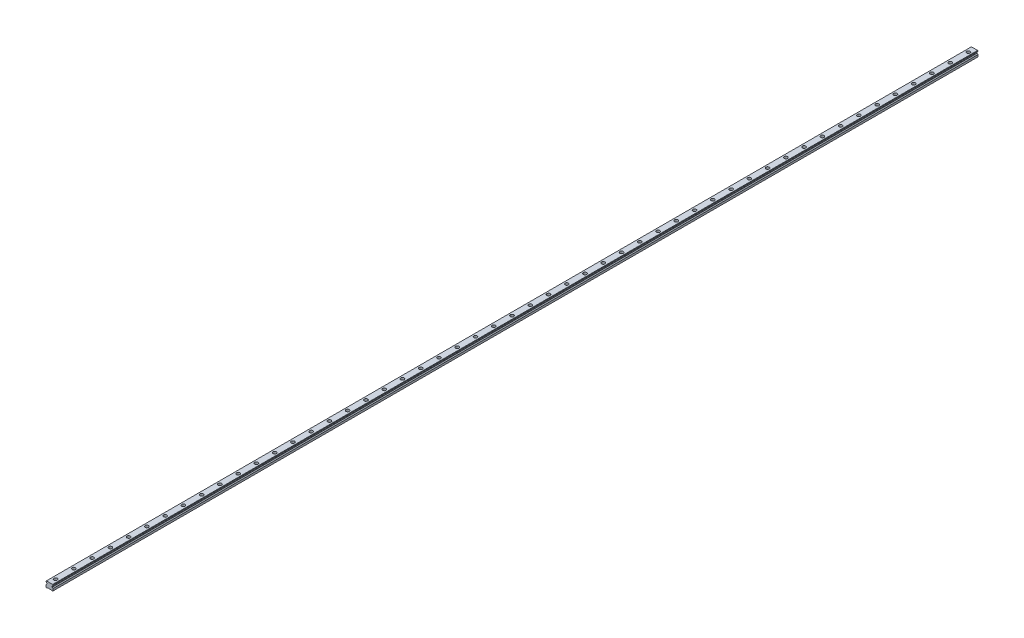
from build123d import *

# Parameters (mm, degrees)
SKETCH1_W           = 23
SKETCH1_H           = 19.2
BOSS_EXTRUDE1_DEPTH = 1520
CUT_EXTRUDE1_DEPTH  = 3041.082382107
CHAMFER1_SIZE       = 1.25
FILLET1_R           = 1.25
CUT_EXTRUDE2_DEPTH  = 3041.082382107
SKETCH4_R           = 5.5
SKETCH4_R_2         = 3.5
CUT_EXTRUDE3_DEPTH  = 9
SKETCH4_2_R         = 3.5
CUT_EXTRUDE4_DEPTH  = 1521.164757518
LPATTERN1_COUNT     = 51
LPATTERN1_PITCH     = 60


with BuildPart() as part:
    # Sketch1 → Boss-Extrude1 (new, symmetric)
    with BuildSketch(Plane.XY):
        with Locations((0, 9.6)):
            Rectangle(SKETCH1_W, SKETCH1_H)
    extrude(amount=BOSS_EXTRUDE1_DEPTH, both=True)

    # Sketch2 → Cut-Extrude1 (cut, through all)
    with BuildSketch(Plane.XY.offset(1520)):
        Polygon((-11.5, 16.7), (-11.5, 7.95), (-8.583333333, 10.866666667), (-8.583333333, 13.783333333), align=None)
        Polygon((8.583333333, 13.783333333), (11.5, 16.7), (11.5, 7.95), (8.583333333, 10.866666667), align=None)
    extrude(amount=-CUT_EXTRUDE1_DEPTH, mode=Mode.SUBTRACT)

    # Chamfer1
    chamfer1_edges = [part.edges().sort_by_distance(p)[0] for p in [
        (-11.5, 19.2, 0),
        (11.5, 19.2, 0),
        (11.5, 0, 0),
        (-11.5, 0, 0),
    ]]
    chamfer(chamfer1_edges, length=CHAMFER1_SIZE)

    # Fillet1
    fillet1_edges = [part.edges().sort_by_distance(p)[0] for p in [
        (-8.583333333, 13.783333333, 0),
        (-8.583333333, 10.866666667, 0),
        (8.583333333, 10.866666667, 0),
        (8.583333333, 13.783333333, 0),
    ]]
    fillet(fillet1_edges, radius=FILLET1_R)

    # Sketch3 → Cut-Extrude2 (cut, through all)
    with BuildSketch(Plane.XY.offset(1520)):
        Polygon((-7, 0), (-5.75, 1.25), (5.75, 1.25), (7, 0), align=None)
    extrude(amount=-CUT_EXTRUDE2_DEPTH, mode=Mode.SUBTRACT)

    # Sketch4 → Cut-Extrude3 (cut)
    with BuildSketch(Plane(origin=(0, 19.2, 0), x_dir=(1, 0, 0), z_dir=(0, 1, 0))):
        with Locations(Location((0, -1500, 0), (0, 0, 270))):
            Circle(SKETCH4_R)
        with Locations(Location((0, -1500, 0), (0, 0, 270))):
            Circle(SKETCH4_R_2, mode=Mode.SUBTRACT)
    cut_extrude3 = extrude(amount=-CUT_EXTRUDE3_DEPTH, mode=Mode.SUBTRACT)

    # Sketch4_2 → Cut-Extrude4 (cut, through all)
    with BuildSketch(Plane(origin=(0, 19.2, 0), x_dir=(1, 0, 0), z_dir=(0, 1, 0))):
        with Locations(Location((0, -1500, 0), (0, 0, 270))):
            Circle(SKETCH4_2_R)
    cut_extrude4 = extrude(amount=-CUT_EXTRUDE4_DEPTH, mode=Mode.SUBTRACT)

    # LPattern1: Cut-Extrude3, Cut-Extrude4 ×51
    with Locations(*[(0, 0, -i * LPATTERN1_PITCH) for i in range(1, LPATTERN1_COUNT)]):
        add(cut_extrude3, mode=Mode.SUBTRACT)
        add(cut_extrude4, mode=Mode.SUBTRACT)


solid = part.part
